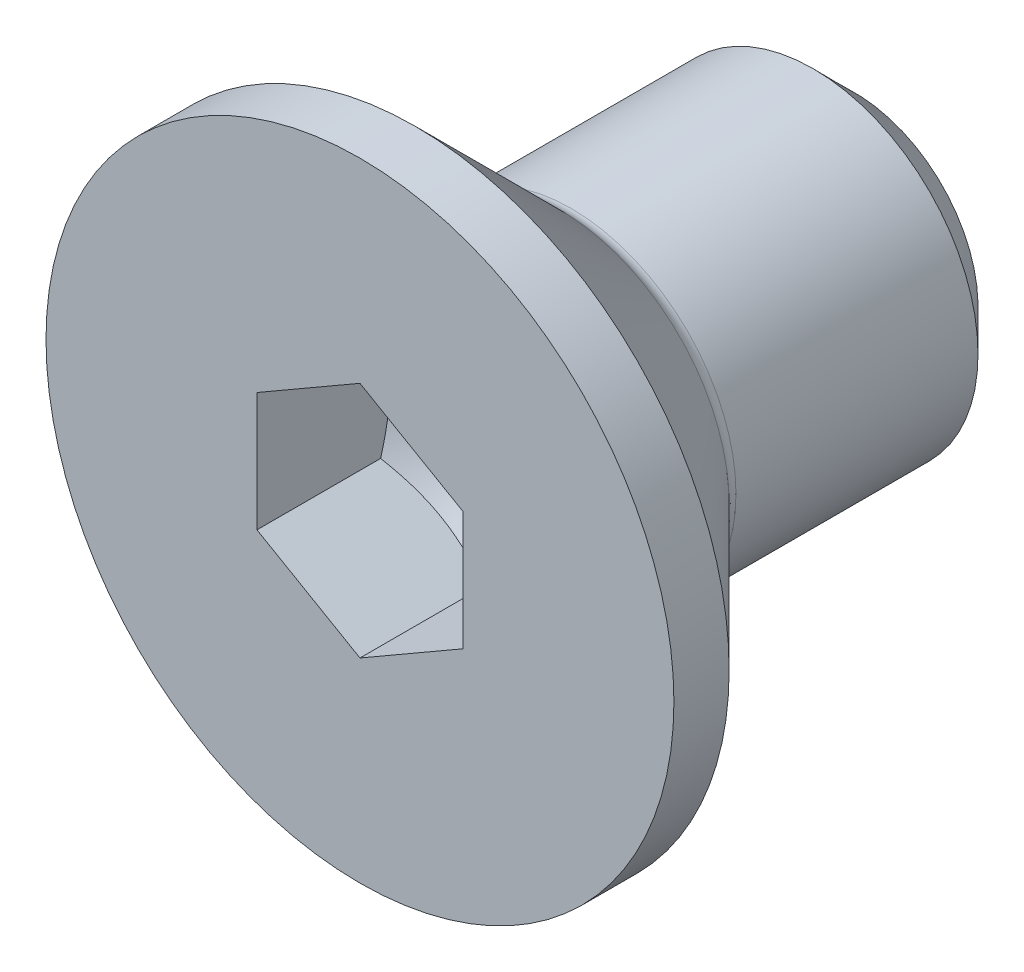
from build123d import *

# Parameters (mm, degrees)
HEXHEAD_DEPTH  = 3
HEXHEAD2_DEPTH = 1.831591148
CHAMFER_2_SIZE = 1
FILLET1_R      = 0.4


with BuildPart() as part:
    # Sketch1 → RevolveBase (revolve)
    with BuildSketch(Plane(origin=(0, 0, 0), x_dir=(0, 0, -1), z_dir=(1, 0, 0)), mode=Mode.PRIVATE) as revolvebase_sk:
        Polygon((0, 0), (0, 7.62), (1.34, 7.62), (4.96, 4), (12, 4), (12, 0), align=None)
    revolve(revolvebase_sk.sketch.rotate(Axis((0, 0, -12), (0, 0, -1)), 180), axis=Axis((0, 0, -12), (0, 0, -1)))

    # Sketch2 → HexHead (cut)
    with BuildSketch(Plane.XY):
        Polygon((0, 2.886751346), (-2.5, 1.443375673), (-2.5, -1.443375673), (0, -2.886751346), (2.5, -1.443375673), (2.5, 1.443375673), align=None)
    extrude(amount=-HEXHEAD_DEPTH, mode=Mode.SUBTRACT)

    # Sketch3 → HexHead2 (cut)
    with BuildSketch(Plane.XY.offset(-3)):
        Polygon((0, 2.886751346), (-2.5, 1.443375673), (-2.5, -1.443375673), (0, -2.886751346), (2.5, -1.443375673), (2.5, 1.443375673), align=None)
    extrude(amount=-HEXHEAD2_DEPTH, mode=Mode.SUBTRACT)

    # Sketch4 → RevolveHead (revolve)
    with BuildSketch(Plane(origin=(0, 0, 0), x_dir=(0, 0, -1), z_dir=(1, 0, 0)), mode=Mode.PRIVATE) as revolvehead_sk:
        Polygon((4.831591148, 0), (4.668109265, 0), (3, 2.88925), (4.831591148, 2.88925), align=None)
    revolve(revolvehead_sk.sketch.rotate(Axis((0, 0, 0), (0, 0, -1)), 90), axis=Axis((0, 0, 0), (0, 0, -1)))

    # Chamfer 2
    chamfer_2_edges = [part.edges().sort_by_distance(p)[0] for p in [
        (0, 4, -12),
    ]]
    chamfer(chamfer_2_edges, length=CHAMFER_2_SIZE)

    # Fillet1
    fillet1_edges = [part.edges().sort_by_distance(p)[0] for p in [
        (0, 4, -4.96),
    ]]
    fillet(fillet1_edges, radius=FILLET1_R)


solid = part.part
